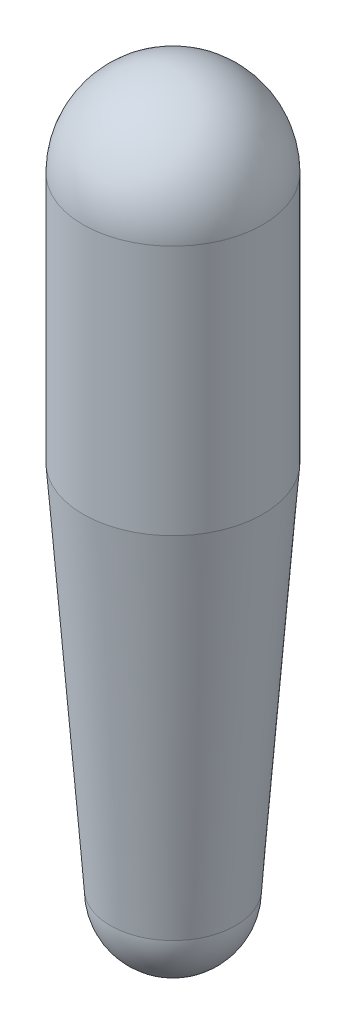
from build123d import *


with BuildPart() as part:
    # Sketch1 → Revolve1 (revolve)
    with BuildSketch(Plane.XY):
        with BuildLine():
            Line((-54.61, 0), (54.61, 0))
            ThreePointArc((54.61, 0), (0, 54.61), (-54.61, 0))
        make_face()
    revolve(axis=Axis((-54.61, 0, 0), (1, 0, 0)))


with BuildPart() as body_2:
    # Sketch2 → Revolve2 (revolve)
    with BuildSketch(Plane.XY):
        with BuildLine():
            Line((-38.1, -377.19), (38.1, -377.19))
            ThreePointArc((38.1, -377.19), (0, -415.29), (-38.1, -377.19))
        make_face()
    revolve(axis=Axis((-38.1, -377.19, 0), (1, 0, 0)))


with BuildPart() as part_1:
    add(part.part)

    add(body_2.part)  # Revolve3 merges body 2
    # Sketch3 → Revolve3 (revolve)
    with BuildSketch(Plane(origin=(0, 0, 0), x_dir=(0, 0, -1), z_dir=(1, 0, 0)), mode=Mode.PRIVATE) as revolve3_sk:
        Polygon((0, 0), (0, -377.19), (38.1, -377.19), (54.61, -152.4), (54.61, 0), align=None)
    revolve(revolve3_sk.sketch.rotate(Axis((0, 0, 0), (0, -1, 0)), 180), axis=Axis((0, 0, 0), (0, -1, 0)))


solid = part_1.part
